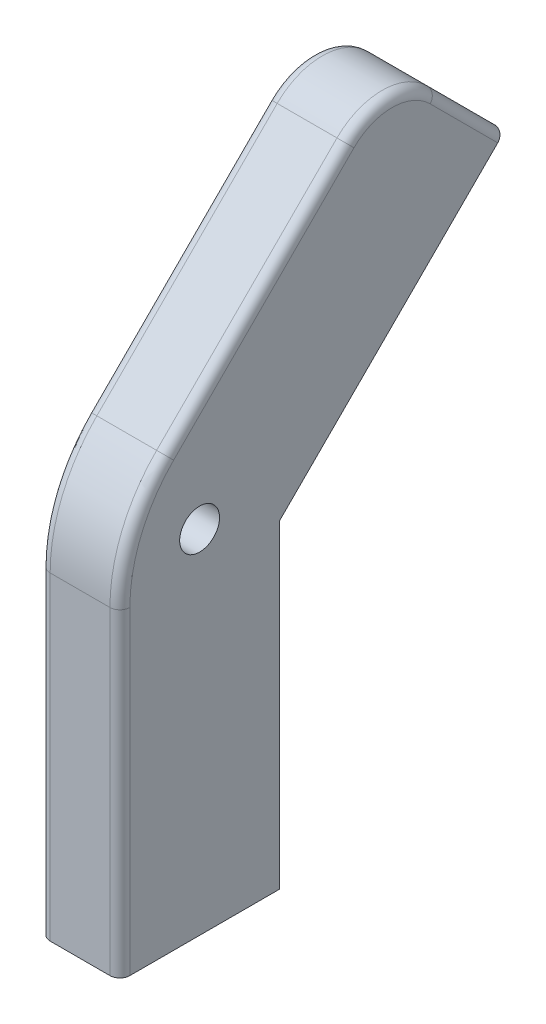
ISO-10303-21;
HEADER;
FILE_DESCRIPTION(('STEP AP214'),'2;1');
FILE_NAME('part.step','',(''),(''),'','','');
FILE_SCHEMA(('AUTOMOTIVE_DESIGN { 1 0 10303 214 1 1 1 1 }'));
ENDSEC;
DATA;
#1=APPLICATION_CONTEXT('core data for automotive mechanical design processes');
#2=APPLICATION_PROTOCOL_DEFINITION('international standard','automotive_design',2000,#1);
#3=PRODUCT_CONTEXT('',#1,'mechanical');
#4=PRODUCT('Part','Part','',(#3));
#5=PRODUCT_RELATED_PRODUCT_CATEGORY('part','',(#4));
#6=PRODUCT_DEFINITION_FORMATION('','',#4);
#7=PRODUCT_DEFINITION_CONTEXT('part definition',#1,'design');
#8=PRODUCT_DEFINITION('design','',#6,#7);
#9=PRODUCT_DEFINITION_SHAPE('','',#8);
#10=(LENGTH_UNIT() NAMED_UNIT(*) SI_UNIT(.MILLI.,.METRE.));
#11=(NAMED_UNIT(*) PLANE_ANGLE_UNIT() SI_UNIT($,.RADIAN.));
#12=(NAMED_UNIT(*) SI_UNIT($,.STERADIAN.) SOLID_ANGLE_UNIT());
#13=UNCERTAINTY_MEASURE_WITH_UNIT(LENGTH_MEASURE(1.E-05),#10,'distance_accuracy_value','');
#14=(GEOMETRIC_REPRESENTATION_CONTEXT(3) GLOBAL_UNCERTAINTY_ASSIGNED_CONTEXT((#13)) GLOBAL_UNIT_ASSIGNED_CONTEXT((#10,
#11,#12)) REPRESENTATION_CONTEXT('',''));
#15=CARTESIAN_POINT('',(0.,0.,0.));
#16=DIRECTION('',(0.,0.,1.));
#17=DIRECTION('',(1.,0.,0.));
#18=AXIS2_PLACEMENT_3D('',#15,#16,#17);
#19=CARTESIAN_POINT('',(3.175,9.87828173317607,-10.8401280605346));
#20=DIRECTION('',(-1.,0.,0.));
#21=DIRECTION('',(0.,0.,1.));
#22=AXIS2_PLACEMENT_3D('',#19,#20,#21);
#23=CYLINDRICAL_SURFACE('',#22,2.54);
#24=DIRECTION('',(-1.,0.,0.));
#25=VECTOR('',#24,1.);
#26=CARTESIAN_POINT('',(3.175,11.6743329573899,-12.6361792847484));
#27=LINE('',#26,#25);
#28=CARTESIAN_POINT('',(0.396875,11.6743329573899,-12.6361792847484));
#29=VERTEX_POINT('',#28);
#30=CARTESIAN_POINT('',(2.778125,11.6743329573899,-12.6361792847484));
#31=VERTEX_POINT('',#30);
#32=EDGE_CURVE('E181',#29,#31,#27,.F.);
#33=ORIENTED_EDGE('',*,*,#32,.F.);
#34=CARTESIAN_POINT('',(0.396875,9.87828173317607,-10.8401280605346));
#35=DIRECTION('',(-1.,0.,0.));
#36=DIRECTION('',(0.,0.,1.));
#37=AXIS2_PLACEMENT_3D('',#34,#35,#36);
#38=CIRCLE('',#37,2.54);
#39=CARTESIAN_POINT('',(0.396875,11.6743329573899,-9.04407683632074));
#40=VERTEX_POINT('',#39);
#41=EDGE_CURVE('E11',#29,#40,#38,.F.);
#42=ORIENTED_EDGE('',*,*,#41,.T.);
#43=DIRECTION('',(-1.,0.,0.));
#44=VECTOR('',#43,1.);
#45=CARTESIAN_POINT('',(3.175,11.6743329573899,-9.04407683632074));
#46=LINE('',#45,#44);
#47=CARTESIAN_POINT('',(2.778125,11.6743329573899,-9.04407683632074));
#48=VERTEX_POINT('',#47);
#49=EDGE_CURVE('E178',#48,#40,#46,.T.);
#50=ORIENTED_EDGE('',*,*,#49,.F.);
#51=CARTESIAN_POINT('',(2.778125,9.87828173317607,-10.8401280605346));
#52=DIRECTION('',(-1.,0.,0.));
#53=DIRECTION('',(0.,0.,1.));
#54=AXIS2_PLACEMENT_3D('',#51,#52,#53);
#55=CIRCLE('',#54,2.54);
#56=EDGE_CURVE('E40',#48,#31,#55,.T.);
#57=ORIENTED_EDGE('',*,*,#56,.T.);
#58=EDGE_LOOP('',(#33,#42,#50,#57));
#59=FACE_BOUND('',#58,.T.);
#60=ADVANCED_FACE('F31',(#59),#23,.T.);
#61=CARTESIAN_POINT('',(3.175,0.,-6.35));
#62=DIRECTION('',(-1.,0.,0.));
#63=DIRECTION('',(0.,0.,1.));
#64=AXIS2_PLACEMENT_3D('',#61,#62,#63);
#65=CYLINDRICAL_SURFACE('',#64,6.35);
#66=DIRECTION('',(-1.,0.,0.));
#67=VECTOR('',#66,1.);
#68=CARTESIAN_POINT('',(3.175,4.49012806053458,-1.85987193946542));
#69=LINE('',#68,#67);
#70=CARTESIAN_POINT('',(2.778125,4.49012806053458,-1.85987193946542));
#71=VERTEX_POINT('',#70);
#72=CARTESIAN_POINT('',(0.396875,4.49012806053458,-1.85987193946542));
#73=VERTEX_POINT('',#72);
#74=EDGE_CURVE('E158',#71,#73,#69,.T.);
#75=ORIENTED_EDGE('',*,*,#74,.T.);
#76=CARTESIAN_POINT('',(0.396875,0.,-6.35));
#77=DIRECTION('',(-1.,0.,0.));
#78=DIRECTION('',(0.,0.,1.));
#79=AXIS2_PLACEMENT_3D('',#76,#77,#78);
#80=CIRCLE('',#79,6.35);
#81=CARTESIAN_POINT('',(0.396875,0.,0.));
#82=VERTEX_POINT('',#81);
#83=EDGE_CURVE('E205',#73,#82,#80,.F.);
#84=ORIENTED_EDGE('',*,*,#83,.T.);
#85=DIRECTION('',(-1.,0.,0.));
#86=VECTOR('',#85,1.);
#87=CARTESIAN_POINT('',(3.175,0.,0.));
#88=LINE('',#87,#86);
#89=CARTESIAN_POINT('',(2.778125,0.,0.));
#90=VERTEX_POINT('',#89);
#91=EDGE_CURVE('E175',#90,#82,#88,.T.);
#92=ORIENTED_EDGE('',*,*,#91,.F.);
#93=CARTESIAN_POINT('',(2.778125,0.,-6.35));
#94=DIRECTION('',(-1.,0.,0.));
#95=DIRECTION('',(0.,0.,1.));
#96=AXIS2_PLACEMENT_3D('',#93,#94,#95);
#97=CIRCLE('',#96,6.35);
#98=EDGE_CURVE('E203',#90,#71,#97,.T.);
#99=ORIENTED_EDGE('',*,*,#98,.T.);
#100=EDGE_LOOP('',(#75,#84,#92,#99));
#101=FACE_BOUND('',#100,.T.);
#102=ADVANCED_FACE('F308',(#101),#65,.T.);
#103=CARTESIAN_POINT('',(3.175,0.,0.));
#104=DIRECTION('',(0.,0.,-1.));
#105=DIRECTION('',(0.,1.,0.));
#106=AXIS2_PLACEMENT_3D('',#103,#104,#105);
#107=PLANE('',#106);
#108=ORIENTED_EDGE('',*,*,#91,.T.);
#109=DIRECTION('',(0.,-1.,0.));
#110=VECTOR('',#109,1.);
#111=CARTESIAN_POINT('',(0.396875,-12.7,0.));
#112=LINE('',#111,#110);
#113=CARTESIAN_POINT('',(0.396875,-12.7,0.));
#114=VERTEX_POINT('',#113);
#115=EDGE_CURVE('E186',#82,#114,#112,.T.);
#116=ORIENTED_EDGE('',*,*,#115,.T.);
#117=DIRECTION('',(-1.,0.,0.));
#118=VECTOR('',#117,1.);
#119=CARTESIAN_POINT('',(3.175,-12.7,0.));
#120=LINE('',#119,#118);
#121=CARTESIAN_POINT('',(2.778125,-12.7,0.));
#122=VERTEX_POINT('',#121);
#123=EDGE_CURVE('E150',#122,#114,#120,.T.);
#124=ORIENTED_EDGE('',*,*,#123,.F.);
#125=DIRECTION('',(0.,-1.,0.));
#126=VECTOR('',#125,1.);
#127=CARTESIAN_POINT('',(2.778125,0.,0.));
#128=LINE('',#127,#126);
#129=EDGE_CURVE('E184',#122,#90,#128,.F.);
#130=ORIENTED_EDGE('',*,*,#129,.T.);
#131=EDGE_LOOP('',(#108,#116,#124,#130));
#132=FACE_BOUND('',#131,.T.);
#133=ADVANCED_FACE('F259',(#132),#107,.F.);
#134=CARTESIAN_POINT('',(3.175,-12.7,0.));
#135=DIRECTION('',(0.,1.,0.));
#136=DIRECTION('',(0.,0.,1.));
#137=AXIS2_PLACEMENT_3D('',#134,#135,#136);
#138=PLANE('',#137);
#139=ORIENTED_EDGE('',*,*,#123,.T.);
#140=CARTESIAN_POINT('',(0.396875,-12.7,-0.396875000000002));
#141=DIRECTION('',(0.,1.,0.));
#142=DIRECTION('',(0.,0.,1.));
#143=AXIS2_PLACEMENT_3D('',#140,#141,#142);
#144=CIRCLE('',#143,0.396875);
#145=CARTESIAN_POINT('',(0.,-12.7,-0.396875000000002));
#146=VERTEX_POINT('',#145);
#147=EDGE_CURVE('E191',#114,#146,#144,.F.);
#148=ORIENTED_EDGE('',*,*,#147,.T.);
#149=DIRECTION('',(0.,0.,-1.));
#150=VECTOR('',#149,1.);
#151=CARTESIAN_POINT('',(0.,-12.7,0.));
#152=LINE('',#151,#150);
#153=CARTESIAN_POINT('',(0.,-12.7,-6.35));
#154=VERTEX_POINT('',#153);
#155=EDGE_CURVE('E147',#146,#154,#152,.T.);
#156=ORIENTED_EDGE('',*,*,#155,.T.);
#157=DIRECTION('',(-1.,0.,0.));
#158=VECTOR('',#157,1.);
#159=CARTESIAN_POINT('',(3.175,-12.7,-6.35));
#160=LINE('',#159,#158);
#161=CARTESIAN_POINT('',(3.175,-12.7,-6.35));
#162=VERTEX_POINT('',#161);
#163=EDGE_CURVE('E143',#162,#154,#160,.T.);
#164=ORIENTED_EDGE('',*,*,#163,.F.);
#165=DIRECTION('',(0.,0.,-1.));
#166=VECTOR('',#165,1.);
#167=CARTESIAN_POINT('',(3.175,-12.7,0.));
#168=LINE('',#167,#166);
#169=CARTESIAN_POINT('',(3.175,-12.7,-0.396875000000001));
#170=VERTEX_POINT('',#169);
#171=EDGE_CURVE('E129',#170,#162,#168,.T.);
#172=ORIENTED_EDGE('',*,*,#171,.F.);
#173=CARTESIAN_POINT('',(2.778125,-12.7,-0.396875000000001));
#174=DIRECTION('',(0.,1.,0.));
#175=DIRECTION('',(0.,0.,1.));
#176=AXIS2_PLACEMENT_3D('',#173,#174,#175);
#177=CIRCLE('',#176,0.396875);
#178=EDGE_CURVE('E189',#170,#122,#177,.F.);
#179=ORIENTED_EDGE('',*,*,#178,.T.);
#180=EDGE_LOOP('',(#139,#148,#156,#164,#172,#179));
#181=FACE_BOUND('',#180,.T.);
#182=ADVANCED_FACE('F145',(#181),#138,.F.);
#183=CARTESIAN_POINT('',(3.175,0.,-6.35));
#184=DIRECTION('',(0.,0.,1.));
#185=DIRECTION('',(0.,-1.,0.));
#186=AXIS2_PLACEMENT_3D('',#183,#184,#185);
#187=PLANE('',#186);
#188=DIRECTION('',(0.,1.,0.));
#189=VECTOR('',#188,1.);
#190=CARTESIAN_POINT('',(0.,0.,-6.35));
#191=LINE('',#190,#189);
#192=CARTESIAN_POINT('',(0.,0.,-6.35));
#193=VERTEX_POINT('',#192);
#194=EDGE_CURVE('E163',#154,#193,#191,.T.);
#195=ORIENTED_EDGE('',*,*,#194,.T.);
#196=DIRECTION('',(-1.,0.,0.));
#197=VECTOR('',#196,1.);
#198=CARTESIAN_POINT('',(3.175,0.,-6.35));
#199=LINE('',#198,#197);
#200=CARTESIAN_POINT('',(3.175,0.,-6.35));
#201=VERTEX_POINT('',#200);
#202=EDGE_CURVE('E151',#201,#193,#199,.T.);
#203=ORIENTED_EDGE('',*,*,#202,.F.);
#204=DIRECTION('',(0.,1.,0.));
#205=VECTOR('',#204,1.);
#206=CARTESIAN_POINT('',(3.175,0.,-6.35));
#207=LINE('',#206,#205);
#208=EDGE_CURVE('E135',#162,#201,#207,.T.);
#209=ORIENTED_EDGE('',*,*,#208,.F.);
#210=ORIENTED_EDGE('',*,*,#163,.T.);
#211=EDGE_LOOP('',(#195,#203,#209,#210));
#212=FACE_BOUND('',#211,.T.);
#213=ADVANCED_FACE('F153',(#212),#187,.F.);
#214=CARTESIAN_POINT('',(3.175,0.,-6.35));
#215=DIRECTION('',(0.,0.707106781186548,0.707106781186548));
#216=DIRECTION('',(0.,-0.707106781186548,0.707106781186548));
#217=AXIS2_PLACEMENT_3D('',#214,#215,#216);
#218=PLANE('',#217);
#219=DIRECTION('',(0.,0.707106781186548,-0.707106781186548));
#220=VECTOR('',#219,1.);
#221=CARTESIAN_POINT('',(0.,0.,-6.35));
#222=LINE('',#221,#220);
#223=CARTESIAN_POINT('',(0.,8.69962311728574,-15.0496231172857));
#224=VERTEX_POINT('',#223);
#225=EDGE_CURVE('E140',#193,#224,#222,.T.);
#226=ORIENTED_EDGE('',*,*,#225,.T.);
#227=CARTESIAN_POINT('',(0.396875,8.69962311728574,-15.0496231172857));
#228=DIRECTION('',(0.,0.707106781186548,0.707106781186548));
#229=DIRECTION('',(0.,-0.707106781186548,0.707106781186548));
#230=AXIS2_PLACEMENT_3D('',#227,#228,#229);
#231=CIRCLE('',#230,0.396875);
#232=CARTESIAN_POINT('',(0.396875,8.98025612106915,-15.3302561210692));
#233=VERTEX_POINT('',#232);
#234=EDGE_CURVE('E217',#224,#233,#231,.F.);
#235=ORIENTED_EDGE('',*,*,#234,.T.);
#236=DIRECTION('',(-1.,0.,0.));
#237=VECTOR('',#236,1.);
#238=CARTESIAN_POINT('',(3.175,8.98025612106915,-15.3302561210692));
#239=LINE('',#238,#237);
#240=CARTESIAN_POINT('',(2.778125,8.98025612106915,-15.3302561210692));
#241=VERTEX_POINT('',#240);
#242=EDGE_CURVE('E170',#241,#233,#239,.T.);
#243=ORIENTED_EDGE('',*,*,#242,.F.);
#244=CARTESIAN_POINT('',(2.778125,8.69962311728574,-15.0496231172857));
#245=DIRECTION('',(0.,0.707106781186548,0.707106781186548));
#246=DIRECTION('',(0.,-0.707106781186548,0.707106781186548));
#247=AXIS2_PLACEMENT_3D('',#244,#245,#246);
#248=CIRCLE('',#247,0.396875);
#249=CARTESIAN_POINT('',(3.175,8.69962311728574,-15.0496231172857));
#250=VERTEX_POINT('',#249);
#251=EDGE_CURVE('E215',#241,#250,#248,.F.);
#252=ORIENTED_EDGE('',*,*,#251,.T.);
#253=DIRECTION('',(0.,0.707106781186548,-0.707106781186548));
#254=VECTOR('',#253,1.);
#255=CARTESIAN_POINT('',(3.175,0.,-6.35));
#256=LINE('',#255,#254);
#257=EDGE_CURVE('E156',#201,#250,#256,.T.);
#258=ORIENTED_EDGE('',*,*,#257,.F.);
#259=ORIENTED_EDGE('',*,*,#202,.T.);
#260=EDGE_LOOP('',(#226,#235,#243,#252,#258,#259));
#261=FACE_BOUND('',#260,.T.);
#262=ADVANCED_FACE('F272',(#261),#218,.F.);
#263=CARTESIAN_POINT('',(3.175,8.98025612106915,-15.3302561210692));
#264=DIRECTION('',(0.,-0.707106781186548,0.707106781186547));
#265=DIRECTION('',(0.,-0.707106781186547,-0.707106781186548));
#266=AXIS2_PLACEMENT_3D('',#263,#264,#265);
#267=PLANE('',#266);
#268=ORIENTED_EDGE('',*,*,#242,.T.);
#269=DIRECTION('',(0.,0.707106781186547,0.707106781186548));
#270=VECTOR('',#269,1.);
#271=CARTESIAN_POINT('',(0.396875,11.6743329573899,-12.6361792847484));
#272=LINE('',#271,#270);
#273=EDGE_CURVE('E213',#233,#29,#272,.T.);
#274=ORIENTED_EDGE('',*,*,#273,.T.);
#275=ORIENTED_EDGE('',*,*,#32,.T.);
#276=DIRECTION('',(0.,0.707106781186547,0.707106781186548));
#277=VECTOR('',#276,1.);
#278=CARTESIAN_POINT('',(2.778125,8.98025612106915,-15.3302561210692));
#279=LINE('',#278,#277);
#280=EDGE_CURVE('E211',#31,#241,#279,.F.);
#281=ORIENTED_EDGE('',*,*,#280,.T.);
#282=EDGE_LOOP('',(#268,#274,#275,#281));
#283=FACE_BOUND('',#282,.T.);
#284=ADVANCED_FACE('F292',(#283),#267,.F.);
#285=CARTESIAN_POINT('',(3.175,13.4703841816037,-10.8401280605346));
#286=DIRECTION('',(0.,-0.707106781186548,-0.707106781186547));
#287=DIRECTION('',(0.,0.707106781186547,-0.707106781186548));
#288=AXIS2_PLACEMENT_3D('',#285,#286,#287);
#289=PLANE('',#288);
#290=ORIENTED_EDGE('',*,*,#49,.T.);
#291=DIRECTION('',(0.,-0.707106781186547,0.707106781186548));
#292=VECTOR('',#291,1.);
#293=CARTESIAN_POINT('',(0.396875,4.49012806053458,-1.85987193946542));
#294=LINE('',#293,#292);
#295=EDGE_CURVE('E209',#40,#73,#294,.T.);
#296=ORIENTED_EDGE('',*,*,#295,.T.);
#297=ORIENTED_EDGE('',*,*,#74,.F.);
#298=DIRECTION('',(0.,-0.707106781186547,0.707106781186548));
#299=VECTOR('',#298,1.);
#300=CARTESIAN_POINT('',(2.778125,13.4703841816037,-10.8401280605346));
#301=LINE('',#300,#299);
#302=EDGE_CURVE('E207',#71,#48,#301,.F.);
#303=ORIENTED_EDGE('',*,*,#302,.T.);
#304=EDGE_LOOP('',(#290,#296,#297,#303));
#305=FACE_BOUND('',#304,.T.);
#306=ADVANCED_FACE('F304',(#305),#289,.F.);
#307=CARTESIAN_POINT('',(3.175,0.,-6.35));
#308=DIRECTION('',(-1.,0.,0.));
#309=DIRECTION('',(0.,0.,1.));
#310=AXIS2_PLACEMENT_3D('',#307,#308,#309);
#311=PLANE('',#310);
#312=ORIENTED_EDGE('',*,*,#257,.T.);
#313=DIRECTION('',(0.,0.707106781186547,0.707106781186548));
#314=VECTOR('',#313,1.);
#315=CARTESIAN_POINT('',(3.175,8.69962311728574,-15.0496231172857));
#316=LINE('',#315,#314);
#317=CARTESIAN_POINT('',(3.175,11.3936999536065,-12.355546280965));
#318=VERTEX_POINT('',#317);
#319=EDGE_CURVE('E224',#250,#318,#316,.T.);
#320=ORIENTED_EDGE('',*,*,#319,.T.);
#321=CARTESIAN_POINT('',(3.175,9.87828173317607,-10.8401280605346));
#322=DIRECTION('',(-1.,0.,0.));
#323=DIRECTION('',(0.,0.,1.));
#324=AXIS2_PLACEMENT_3D('',#321,#322,#323);
#325=CIRCLE('',#324,2.143125);
#326=CARTESIAN_POINT('',(3.175,11.3936999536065,-9.32470984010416));
#327=VERTEX_POINT('',#326);
#328=EDGE_CURVE('E219',#318,#327,#325,.F.);
#329=ORIENTED_EDGE('',*,*,#328,.T.);
#330=DIRECTION('',(0.,-0.707106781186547,0.707106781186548));
#331=VECTOR('',#330,1.);
#332=CARTESIAN_POINT('',(3.175,4.20949505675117,-2.14050494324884));
#333=LINE('',#332,#331);
#334=CARTESIAN_POINT('',(3.175,4.20949505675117,-2.14050494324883));
#335=VERTEX_POINT('',#334);
#336=EDGE_CURVE('E53',#327,#335,#333,.T.);
#337=ORIENTED_EDGE('',*,*,#336,.T.);
#338=CARTESIAN_POINT('',(3.175,0.,-6.35));
#339=DIRECTION('',(-1.,0.,0.));
#340=DIRECTION('',(0.,0.,1.));
#341=AXIS2_PLACEMENT_3D('',#338,#339,#340);
#342=CIRCLE('',#341,5.953125);
#343=CARTESIAN_POINT('',(3.175,0.,-0.396875));
#344=VERTEX_POINT('',#343);
#345=EDGE_CURVE('E48',#335,#344,#342,.F.);
#346=ORIENTED_EDGE('',*,*,#345,.T.);
#347=DIRECTION('',(0.,-1.,0.));
#348=VECTOR('',#347,1.);
#349=CARTESIAN_POINT('',(3.175,0.,-0.396875));
#350=LINE('',#349,#348);
#351=EDGE_CURVE('E137',#344,#170,#350,.T.);
#352=ORIENTED_EDGE('',*,*,#351,.T.);
#353=ORIENTED_EDGE('',*,*,#171,.T.);
#354=ORIENTED_EDGE('',*,*,#208,.T.);
#355=EDGE_LOOP('',(#312,#320,#329,#337,#346,#352,#353,#354));
#356=FACE_BOUND('',#355,.T.);
#357=CARTESIAN_POINT('',(3.175,1.31512806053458,-3.175));
#358=DIRECTION('',(1.,0.,0.));
#359=DIRECTION('',(0.,0.,-1.));
#360=AXIS2_PLACEMENT_3D('',#357,#358,#359);
#361=CIRCLE('',#360,0.79375);
#362=CARTESIAN_POINT('',(3.175,1.31512806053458,-3.96875));
#363=VERTEX_POINT('',#362);
#364=EDGE_CURVE('E240',#363,#363,#361,.T.);
#365=ORIENTED_EDGE('',*,*,#364,.F.);
#366=EDGE_LOOP('',(#365));
#367=FACE_BOUND('',#366,.T.);
#368=ADVANCED_FACE('F132',(#356,#367),#311,.F.);
#369=CARTESIAN_POINT('',(0.,0.,-6.35));
#370=DIRECTION('',(-1.,0.,0.));
#371=DIRECTION('',(0.,0.,1.));
#372=AXIS2_PLACEMENT_3D('',#369,#370,#371);
#373=PLANE('',#372);
#374=ORIENTED_EDGE('',*,*,#155,.F.);
#375=DIRECTION('',(0.,-1.,0.));
#376=VECTOR('',#375,1.);
#377=CARTESIAN_POINT('',(0.,0.,-0.396875));
#378=LINE('',#377,#376);
#379=CARTESIAN_POINT('',(0.,0.,-0.396875));
#380=VERTEX_POINT('',#379);
#381=EDGE_CURVE('E201',#146,#380,#378,.F.);
#382=ORIENTED_EDGE('',*,*,#381,.T.);
#383=CARTESIAN_POINT('',(0.,0.,-6.35));
#384=DIRECTION('',(-1.,0.,0.));
#385=DIRECTION('',(0.,0.,1.));
#386=AXIS2_PLACEMENT_3D('',#383,#384,#385);
#387=CIRCLE('',#386,5.953125);
#388=CARTESIAN_POINT('',(0.,4.20949505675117,-2.14050494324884));
#389=VERTEX_POINT('',#388);
#390=EDGE_CURVE('E199',#380,#389,#387,.T.);
#391=ORIENTED_EDGE('',*,*,#390,.T.);
#392=DIRECTION('',(0.,-0.707106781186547,0.707106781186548));
#393=VECTOR('',#392,1.);
#394=CARTESIAN_POINT('',(0.,11.3936999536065,-9.32470984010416));
#395=LINE('',#394,#393);
#396=CARTESIAN_POINT('',(0.,11.3936999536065,-9.32470984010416));
#397=VERTEX_POINT('',#396);
#398=EDGE_CURVE('E197',#389,#397,#395,.F.);
#399=ORIENTED_EDGE('',*,*,#398,.T.);
#400=CARTESIAN_POINT('',(0.,9.87828173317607,-10.8401280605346));
#401=DIRECTION('',(-1.,0.,0.));
#402=DIRECTION('',(0.,0.,1.));
#403=AXIS2_PLACEMENT_3D('',#400,#401,#402);
#404=CIRCLE('',#403,2.143125);
#405=CARTESIAN_POINT('',(0.,11.3936999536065,-12.355546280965));
#406=VERTEX_POINT('',#405);
#407=EDGE_CURVE('E193',#397,#406,#404,.T.);
#408=ORIENTED_EDGE('',*,*,#407,.T.);
#409=DIRECTION('',(0.,0.707106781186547,0.707106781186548));
#410=VECTOR('',#409,1.);
#411=CARTESIAN_POINT('',(0.,8.69962311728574,-15.0496231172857));
#412=LINE('',#411,#410);
#413=EDGE_CURVE('E195',#406,#224,#412,.F.);
#414=ORIENTED_EDGE('',*,*,#413,.T.);
#415=ORIENTED_EDGE('',*,*,#225,.F.);
#416=ORIENTED_EDGE('',*,*,#194,.F.);
#417=EDGE_LOOP('',(#374,#382,#391,#399,#408,#414,#415,#416));
#418=FACE_BOUND('',#417,.T.);
#419=CARTESIAN_POINT('',(0.,1.31512806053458,-3.175));
#420=DIRECTION('',(1.,0.,0.));
#421=DIRECTION('',(0.,0.,-1.));
#422=AXIS2_PLACEMENT_3D('',#419,#420,#421);
#423=CIRCLE('',#422,0.79375);
#424=CARTESIAN_POINT('',(0.,1.31512806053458,-3.96875));
#425=VERTEX_POINT('',#424);
#426=EDGE_CURVE('E164',#425,#425,#423,.T.);
#427=ORIENTED_EDGE('',*,*,#426,.T.);
#428=EDGE_LOOP('',(#427));
#429=FACE_BOUND('',#428,.T.);
#430=ADVANCED_FACE('F267',(#418,#429),#373,.T.);
#431=CARTESIAN_POINT('',(0.,1.31512806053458,-3.175));
#432=DIRECTION('',(1.,0.,0.));
#433=DIRECTION('',(0.,0.,-1.));
#434=AXIS2_PLACEMENT_3D('',#431,#432,#433);
#435=CYLINDRICAL_SURFACE('',#434,0.79375);
#436=ORIENTED_EDGE('',*,*,#426,.F.);
#437=EDGE_LOOP('',(#436));
#438=FACE_BOUND('',#437,.T.);
#439=ORIENTED_EDGE('',*,*,#364,.T.);
#440=EDGE_LOOP('',(#439));
#441=FACE_BOUND('',#440,.T.);
#442=ADVANCED_FACE('F344',(#438,#441),#435,.F.);
#443=CARTESIAN_POINT('',(0.396875,8.69962311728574,-15.0496231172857));
#444=DIRECTION('',(0.,-0.707106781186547,-0.707106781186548));
#445=DIRECTION('',(0.,0.707106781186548,-0.707106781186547));
#446=AXIS2_PLACEMENT_3D('',#443,#444,#445);
#447=CYLINDRICAL_SURFACE('',#446,0.396875);
#448=ORIENTED_EDGE('',*,*,#234,.F.);
#449=ORIENTED_EDGE('',*,*,#413,.F.);
#450=CARTESIAN_POINT('',(0.396875,11.3936999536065,-12.355546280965));
#451=DIRECTION('',(0.,0.707106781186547,0.707106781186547));
#452=DIRECTION('',(0.,-0.707106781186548,0.707106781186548));
#453=AXIS2_PLACEMENT_3D('',#450,#451,#452);
#454=CIRCLE('',#453,0.396875);
#455=EDGE_CURVE('E237',#29,#406,#454,.T.);
#456=ORIENTED_EDGE('',*,*,#455,.F.);
#457=ORIENTED_EDGE('',*,*,#273,.F.);
#458=EDGE_LOOP('',(#448,#449,#456,#457));
#459=FACE_BOUND('',#458,.T.);
#460=ADVANCED_FACE('F295',(#459),#447,.T.);
#461=CARTESIAN_POINT('',(0.396875,9.87828173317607,-10.8401280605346));
#462=DIRECTION('',(-1.,0.,0.));
#463=DIRECTION('',(0.,0.,1.));
#464=AXIS2_PLACEMENT_3D('',#461,#462,#463);
#465=TOROIDAL_SURFACE('',#464,2.143125,0.396875);
#466=ORIENTED_EDGE('',*,*,#455,.T.);
#467=ORIENTED_EDGE('',*,*,#407,.F.);
#468=CARTESIAN_POINT('',(0.396875,11.3936999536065,-9.32470984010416));
#469=DIRECTION('',(0.,-0.707106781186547,0.707106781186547));
#470=DIRECTION('',(0.,-0.707106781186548,-0.707106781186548));
#471=AXIS2_PLACEMENT_3D('',#468,#469,#470);
#472=CIRCLE('',#471,0.396875);
#473=EDGE_CURVE('E234',#40,#397,#472,.T.);
#474=ORIENTED_EDGE('',*,*,#473,.F.);
#475=ORIENTED_EDGE('',*,*,#41,.F.);
#476=EDGE_LOOP('',(#466,#467,#474,#475));
#477=FACE_BOUND('',#476,.T.);
#478=ADVANCED_FACE('F301',(#477),#465,.T.);
#479=CARTESIAN_POINT('',(0.396875,13.1897511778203,-11.120761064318));
#480=DIRECTION('',(0.,0.707106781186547,-0.707106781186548));
#481=DIRECTION('',(0.,0.707106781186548,0.707106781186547));
#482=AXIS2_PLACEMENT_3D('',#479,#480,#481);
#483=CYLINDRICAL_SURFACE('',#482,0.396875);
#484=ORIENTED_EDGE('',*,*,#473,.T.);
#485=ORIENTED_EDGE('',*,*,#398,.F.);
#486=CARTESIAN_POINT('',(0.396875,4.20949505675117,-2.14050494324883));
#487=DIRECTION('',(0.,-0.707106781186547,0.707106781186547));
#488=DIRECTION('',(0.,-0.707106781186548,-0.707106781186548));
#489=AXIS2_PLACEMENT_3D('',#486,#487,#488);
#490=CIRCLE('',#489,0.396875);
#491=EDGE_CURVE('E231',#73,#389,#490,.T.);
#492=ORIENTED_EDGE('',*,*,#491,.F.);
#493=ORIENTED_EDGE('',*,*,#295,.F.);
#494=EDGE_LOOP('',(#484,#485,#492,#493));
#495=FACE_BOUND('',#494,.T.);
#496=ADVANCED_FACE('F312',(#495),#483,.T.);
#497=CARTESIAN_POINT('',(0.396875,0.,-6.35));
#498=DIRECTION('',(-1.,0.,0.));
#499=DIRECTION('',(0.,0.,1.));
#500=AXIS2_PLACEMENT_3D('',#497,#498,#499);
#501=TOROIDAL_SURFACE('',#500,5.953125,0.396875);
#502=ORIENTED_EDGE('',*,*,#491,.T.);
#503=ORIENTED_EDGE('',*,*,#390,.F.);
#504=CARTESIAN_POINT('',(0.396875,0.,-0.396875));
#505=DIRECTION('',(0.,-1.,0.));
#506=DIRECTION('',(1.,0.,0.));
#507=AXIS2_PLACEMENT_3D('',#504,#505,#506);
#508=CIRCLE('',#507,0.396875);
#509=EDGE_CURVE('E228',#82,#380,#508,.T.);
#510=ORIENTED_EDGE('',*,*,#509,.F.);
#511=ORIENTED_EDGE('',*,*,#83,.F.);
#512=EDGE_LOOP('',(#502,#503,#510,#511));
#513=FACE_BOUND('',#512,.T.);
#514=ADVANCED_FACE('F314',(#513),#501,.T.);
#515=CARTESIAN_POINT('',(0.396875,0.,-0.396875));
#516=DIRECTION('',(0.,1.,0.));
#517=DIRECTION('',(0.,0.,1.));
#518=AXIS2_PLACEMENT_3D('',#515,#516,#517);
#519=CYLINDRICAL_SURFACE('',#518,0.396875);
#520=ORIENTED_EDGE('',*,*,#509,.T.);
#521=ORIENTED_EDGE('',*,*,#381,.F.);
#522=ORIENTED_EDGE('',*,*,#147,.F.);
#523=ORIENTED_EDGE('',*,*,#115,.F.);
#524=EDGE_LOOP('',(#520,#521,#522,#523));
#525=FACE_BOUND('',#524,.T.);
#526=ADVANCED_FACE('F264',(#525),#519,.T.);
#527=CARTESIAN_POINT('',(2.778125,0.,-0.396875));
#528=DIRECTION('',(0.,-1.,0.));
#529=DIRECTION('',(0.,0.,-1.));
#530=AXIS2_PLACEMENT_3D('',#527,#528,#529);
#531=CYLINDRICAL_SURFACE('',#530,0.396875);
#532=ORIENTED_EDGE('',*,*,#178,.F.);
#533=ORIENTED_EDGE('',*,*,#351,.F.);
#534=CARTESIAN_POINT('',(2.778125,0.,-0.396875));
#535=DIRECTION('',(0.,1.,0.));
#536=DIRECTION('',(0.,0.,1.));
#537=AXIS2_PLACEMENT_3D('',#534,#535,#536);
#538=CIRCLE('',#537,0.396875);
#539=EDGE_CURVE('E35',#90,#344,#538,.T.);
#540=ORIENTED_EDGE('',*,*,#539,.F.);
#541=ORIENTED_EDGE('',*,*,#129,.F.);
#542=EDGE_LOOP('',(#532,#533,#540,#541));
#543=FACE_BOUND('',#542,.T.);
#544=ADVANCED_FACE('F33',(#543),#531,.T.);
#545=CARTESIAN_POINT('',(2.778125,0.,-6.35));
#546=DIRECTION('',(-1.,0.,0.));
#547=DIRECTION('',(0.,0.,1.));
#548=AXIS2_PLACEMENT_3D('',#545,#546,#547);
#549=TOROIDAL_SURFACE('',#548,5.953125,0.396875);
#550=ORIENTED_EDGE('',*,*,#539,.T.);
#551=ORIENTED_EDGE('',*,*,#345,.F.);
#552=CARTESIAN_POINT('',(2.778125,4.20949505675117,-2.14050494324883));
#553=DIRECTION('',(0.,0.707106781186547,-0.707106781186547));
#554=DIRECTION('',(0.,0.707106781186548,0.707106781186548));
#555=AXIS2_PLACEMENT_3D('',#552,#553,#554);
#556=CIRCLE('',#555,0.396875);
#557=EDGE_CURVE('E245',#71,#335,#556,.T.);
#558=ORIENTED_EDGE('',*,*,#557,.F.);
#559=ORIENTED_EDGE('',*,*,#98,.F.);
#560=EDGE_LOOP('',(#550,#551,#558,#559));
#561=FACE_BOUND('',#560,.T.);
#562=ADVANCED_FACE('F254',(#561),#549,.T.);
#563=CARTESIAN_POINT('',(2.778125,4.20949505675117,-2.14050494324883));
#564=DIRECTION('',(0.,-0.707106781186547,0.707106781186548));
#565=DIRECTION('',(0.,-0.707106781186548,-0.707106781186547));
#566=AXIS2_PLACEMENT_3D('',#563,#564,#565);
#567=CYLINDRICAL_SURFACE('',#566,0.396875);
#568=ORIENTED_EDGE('',*,*,#557,.T.);
#569=ORIENTED_EDGE('',*,*,#336,.F.);
#570=CARTESIAN_POINT('',(2.778125,11.3936999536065,-9.32470984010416));
#571=DIRECTION('',(0.,0.707106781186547,-0.707106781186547));
#572=DIRECTION('',(0.,0.707106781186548,0.707106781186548));
#573=AXIS2_PLACEMENT_3D('',#570,#571,#572);
#574=CIRCLE('',#573,0.396875);
#575=EDGE_CURVE('E243',#48,#327,#574,.T.);
#576=ORIENTED_EDGE('',*,*,#575,.F.);
#577=ORIENTED_EDGE('',*,*,#302,.F.);
#578=EDGE_LOOP('',(#568,#569,#576,#577));
#579=FACE_BOUND('',#578,.T.);
#580=ADVANCED_FACE('F286',(#579),#567,.T.);
#581=CARTESIAN_POINT('',(2.778125,9.87828173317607,-10.8401280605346));
#582=DIRECTION('',(-1.,0.,0.));
#583=DIRECTION('',(0.,0.,1.));
#584=AXIS2_PLACEMENT_3D('',#581,#582,#583);
#585=TOROIDAL_SURFACE('',#584,2.143125,0.396875);
#586=ORIENTED_EDGE('',*,*,#575,.T.);
#587=ORIENTED_EDGE('',*,*,#328,.F.);
#588=CARTESIAN_POINT('',(2.778125,11.3936999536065,-12.355546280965));
#589=DIRECTION('',(0.,-0.707106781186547,-0.707106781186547));
#590=DIRECTION('',(0.,0.707106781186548,-0.707106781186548));
#591=AXIS2_PLACEMENT_3D('',#588,#589,#590);
#592=CIRCLE('',#591,0.396875);
#593=EDGE_CURVE('E241',#31,#318,#592,.T.);
#594=ORIENTED_EDGE('',*,*,#593,.F.);
#595=ORIENTED_EDGE('',*,*,#56,.F.);
#596=EDGE_LOOP('',(#586,#587,#594,#595));
#597=FACE_BOUND('',#596,.T.);
#598=ADVANCED_FACE('F284',(#597),#585,.T.);
#599=CARTESIAN_POINT('',(2.778125,8.69962311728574,-15.0496231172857));
#600=DIRECTION('',(0.,0.707106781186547,0.707106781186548));
#601=DIRECTION('',(0.,-0.707106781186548,0.707106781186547));
#602=AXIS2_PLACEMENT_3D('',#599,#600,#601);
#603=CYLINDRICAL_SURFACE('',#602,0.396875);
#604=ORIENTED_EDGE('',*,*,#251,.F.);
#605=ORIENTED_EDGE('',*,*,#280,.F.);
#606=ORIENTED_EDGE('',*,*,#593,.T.);
#607=ORIENTED_EDGE('',*,*,#319,.F.);
#608=EDGE_LOOP('',(#604,#605,#606,#607));
#609=FACE_BOUND('',#608,.T.);
#610=ADVANCED_FACE('F278',(#609),#603,.T.);
#611=CLOSED_SHELL('',(#60,#102,#133,#182,#213,#262,#284,#306,#368,#430,#442,#460,#478,#496,#514,
#526,#544,#562,#580,#598,#610));
#612=MANIFOLD_SOLID_BREP('B2',#611);
#613=ADVANCED_BREP_SHAPE_REPRESENTATION('',(#18,#612),#14);
#614=SHAPE_DEFINITION_REPRESENTATION(#9,#613);
ENDSEC;
END-ISO-10303-21;
